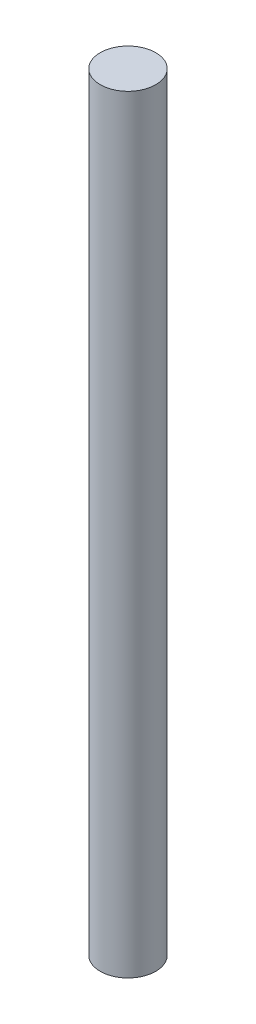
from build123d import *

# Parameters (mm, degrees)
ESQUISSE1_R      = 3
EXTRUSION1_DEPTH = 83


with BuildPart() as part:
    # Esquisse1 → Extrusion1 (new body)
    with BuildSketch(Plane(origin=(0, 0, 0), x_dir=(1, 0, 0), z_dir=(0, 1, 0))):
        with Locations(Location((0, 0, 0), (0, 0, 270))):
            Circle(ESQUISSE1_R)
    extrude(amount=EXTRUSION1_DEPTH)


solid = part.part
